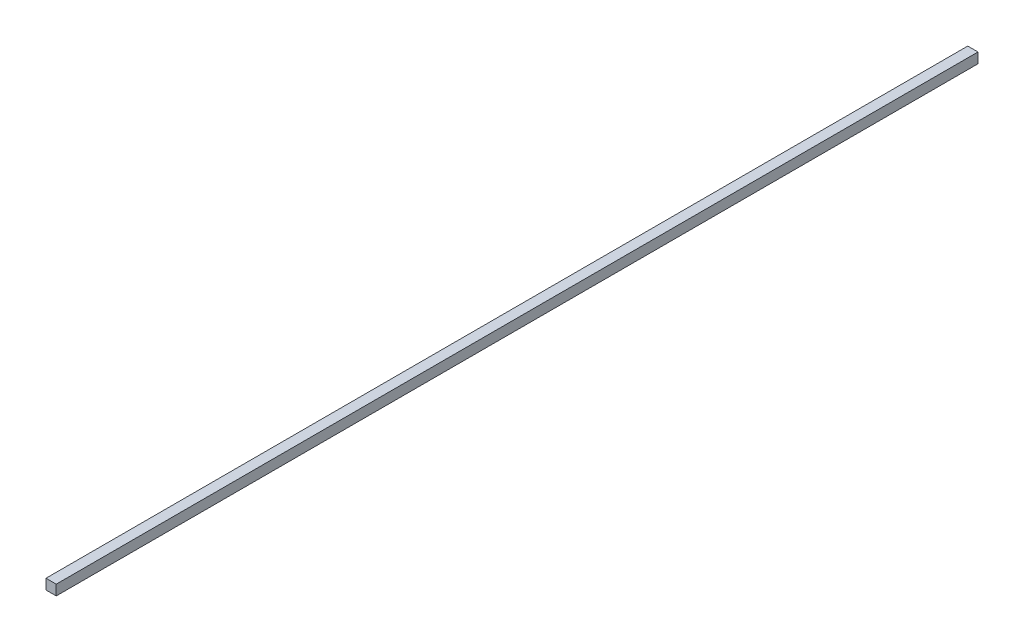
from build123d import *

# Parameters (mm, degrees)
ESQUISSE1_W      = 2
ESQUISSE1_H      = 2
EXTRUSION1_DEPTH = 90


with BuildPart() as part:
    # Esquisse1 → Extrusion1 (new, symmetric)
    with BuildSketch(Plane.XY):
        Rectangle(ESQUISSE1_W, ESQUISSE1_H)
    extrude(amount=EXTRUSION1_DEPTH, both=True)


solid = part.part
